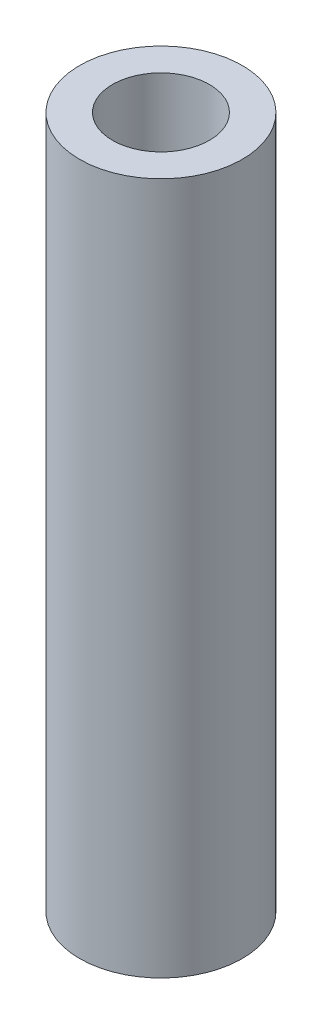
from build123d import *

# Parameters (mm, degrees)
SKETCH1_R      = 2.3876
EXTRUDE1_DEPTH = 20.32


with BuildPart() as part:
    # Sketch1 → Extrude1 (new body)
    with BuildSketch(Plane(origin=(0, 0, 0), x_dir=(1, 0, 0), z_dir=(0, 1, 0))):
        with Locations(Location((0, 0, 0), (0, 0, 270))):
            Circle(SKETCH1_R)
    extrude(amount=EXTRUDE1_DEPTH)

    # Sketch3 → 4-40 Tapped Hole1 (revolve, cut)
    with BuildSketch(Plane(origin=(0, 20.32, 0), x_dir=(0, 0, 1), z_dir=(1, 0, 0))):
        Polygon((0, 0), (0, 13.633152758), (1.1303, 12.954), (1.1303, 9.652), (1.4224, 9.652), (1.4224, 0), align=None)
    revolve(axis=Axis((0, 26.67, 0), (0, -1, 0)), mode=Mode.SUBTRACT)


solid = part.part
